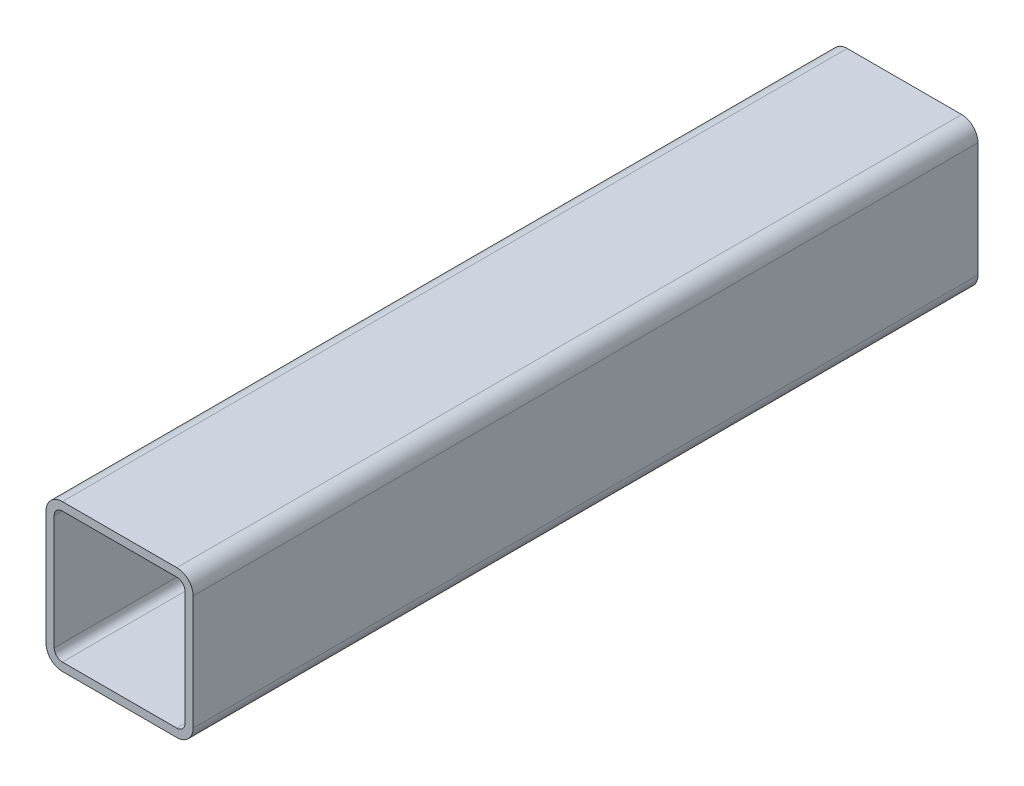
ISO-10303-21;
HEADER;
FILE_DESCRIPTION(('STEP AP214'),'2;1');
FILE_NAME('part.step','',(''),(''),'','','');
FILE_SCHEMA(('AUTOMOTIVE_DESIGN { 1 0 10303 214 1 1 1 1 }'));
ENDSEC;
DATA;
#1=APPLICATION_CONTEXT('core data for automotive mechanical design processes');
#2=APPLICATION_PROTOCOL_DEFINITION('international standard','automotive_design',2000,#1);
#3=PRODUCT_CONTEXT('',#1,'mechanical');
#4=PRODUCT('Part','Part','',(#3));
#5=PRODUCT_RELATED_PRODUCT_CATEGORY('part','',(#4));
#6=PRODUCT_DEFINITION_FORMATION('','',#4);
#7=PRODUCT_DEFINITION_CONTEXT('part definition',#1,'design');
#8=PRODUCT_DEFINITION('design','',#6,#7);
#9=PRODUCT_DEFINITION_SHAPE('','',#8);
#10=(LENGTH_UNIT() NAMED_UNIT(*) SI_UNIT(.MILLI.,.METRE.));
#11=(NAMED_UNIT(*) PLANE_ANGLE_UNIT() SI_UNIT($,.RADIAN.));
#12=(NAMED_UNIT(*) SI_UNIT($,.STERADIAN.) SOLID_ANGLE_UNIT());
#13=UNCERTAINTY_MEASURE_WITH_UNIT(LENGTH_MEASURE(1.E-05),#10,'distance_accuracy_value','');
#14=(GEOMETRIC_REPRESENTATION_CONTEXT(3) GLOBAL_UNCERTAINTY_ASSIGNED_CONTEXT((#13)) GLOBAL_UNIT_ASSIGNED_CONTEXT((#10,
#11,#12)) REPRESENTATION_CONTEXT('',''));
#15=CARTESIAN_POINT('',(0.,0.,0.));
#16=DIRECTION('',(0.,0.,1.));
#17=DIRECTION('',(1.,0.,0.));
#18=AXIS2_PLACEMENT_3D('',#15,#16,#17);
#19=CARTESIAN_POINT('',(6.47805425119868,52.2640005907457,304.8));
#20=DIRECTION('',(0.,0.,1.));
#21=DIRECTION('',(1.,0.,0.));
#22=AXIS2_PLACEMENT_3D('',#19,#20,#21);
#23=PLANE('',#22);
#24=CARTESIAN_POINT('',(6.47805425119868,52.2640005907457,304.8));
#25=DIRECTION('',(0.,0.,1.));
#26=DIRECTION('',(1.,0.,0.));
#27=AXIS2_PLACEMENT_3D('',#24,#25,#26);
#28=CIRCLE('',#27,6.34999999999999);
#29=CARTESIAN_POINT('',(6.47805425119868,58.6140005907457,304.8));
#30=VERTEX_POINT('',#29);
#31=CARTESIAN_POINT('',(0.128054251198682,52.2640005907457,304.8));
#32=VERTEX_POINT('',#31);
#33=EDGE_CURVE('E211',#30,#32,#28,.T.);
#34=ORIENTED_EDGE('',*,*,#33,.T.);
#35=DIRECTION('',(0.,-1.,0.));
#36=VECTOR('',#35,1.);
#37=CARTESIAN_POINT('',(0.128054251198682,7.81400059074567,304.8));
#38=LINE('',#37,#36);
#39=CARTESIAN_POINT('',(0.128054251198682,7.81400059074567,304.8));
#40=VERTEX_POINT('',#39);
#41=EDGE_CURVE('E214',#32,#40,#38,.T.);
#42=ORIENTED_EDGE('',*,*,#41,.T.);
#43=CARTESIAN_POINT('',(6.47805425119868,7.81400059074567,304.8));
#44=DIRECTION('',(0.,0.,1.));
#45=DIRECTION('',(1.,0.,0.));
#46=AXIS2_PLACEMENT_3D('',#43,#44,#45);
#47=CIRCLE('',#46,6.34999999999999);
#48=CARTESIAN_POINT('',(6.47805425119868,1.46400059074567,304.8));
#49=VERTEX_POINT('',#48);
#50=EDGE_CURVE('E217',#40,#49,#47,.T.);
#51=ORIENTED_EDGE('',*,*,#50,.T.);
#52=DIRECTION('',(1.,0.,0.));
#53=VECTOR('',#52,1.);
#54=CARTESIAN_POINT('',(50.9280542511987,1.46400059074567,304.8));
#55=LINE('',#54,#53);
#56=CARTESIAN_POINT('',(50.9280542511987,1.46400059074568,304.8));
#57=VERTEX_POINT('',#56);
#58=EDGE_CURVE('E219',#49,#57,#55,.T.);
#59=ORIENTED_EDGE('',*,*,#58,.T.);
#60=CARTESIAN_POINT('',(50.9280542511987,7.81400059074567,304.8));
#61=DIRECTION('',(0.,0.,1.));
#62=DIRECTION('',(1.,0.,0.));
#63=AXIS2_PLACEMENT_3D('',#60,#61,#62);
#64=CIRCLE('',#63,6.34999999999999);
#65=CARTESIAN_POINT('',(57.2780542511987,7.81400059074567,304.8));
#66=VERTEX_POINT('',#65);
#67=EDGE_CURVE('E221',#57,#66,#64,.T.);
#68=ORIENTED_EDGE('',*,*,#67,.T.);
#69=DIRECTION('',(0.,1.,0.));
#70=VECTOR('',#69,1.);
#71=CARTESIAN_POINT('',(57.2780542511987,52.2640005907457,304.8));
#72=LINE('',#71,#70);
#73=CARTESIAN_POINT('',(57.2780542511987,52.2640005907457,304.8));
#74=VERTEX_POINT('',#73);
#75=EDGE_CURVE('E223',#66,#74,#72,.T.);
#76=ORIENTED_EDGE('',*,*,#75,.T.);
#77=CARTESIAN_POINT('',(50.9280542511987,52.2640005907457,304.8));
#78=DIRECTION('',(0.,0.,1.));
#79=DIRECTION('',(1.,0.,0.));
#80=AXIS2_PLACEMENT_3D('',#77,#78,#79);
#81=CIRCLE('',#80,6.34999999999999);
#82=CARTESIAN_POINT('',(50.9280542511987,58.6140005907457,304.8));
#83=VERTEX_POINT('',#82);
#84=EDGE_CURVE('E225',#74,#83,#81,.T.);
#85=ORIENTED_EDGE('',*,*,#84,.T.);
#86=DIRECTION('',(-1.,0.,0.));
#87=VECTOR('',#86,1.);
#88=CARTESIAN_POINT('',(6.47805425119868,58.6140005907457,304.8));
#89=LINE('',#88,#87);
#90=EDGE_CURVE('E227',#83,#30,#89,.T.);
#91=ORIENTED_EDGE('',*,*,#90,.T.);
#92=EDGE_LOOP('',(#34,#42,#51,#59,#68,#76,#85,#91));
#93=FACE_BOUND('',#92,.T.);
#94=DIRECTION('',(0.,-1.,0.));
#95=VECTOR('',#94,1.);
#96=CARTESIAN_POINT('',(3.30305425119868,7.81400059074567,304.8));
#97=LINE('',#96,#95);
#98=CARTESIAN_POINT('',(3.30305425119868,52.2640005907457,304.8));
#99=VERTEX_POINT('',#98);
#100=CARTESIAN_POINT('',(3.30305425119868,7.81400059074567,304.8));
#101=VERTEX_POINT('',#100);
#102=EDGE_CURVE('E154',#99,#101,#97,.T.);
#103=ORIENTED_EDGE('',*,*,#102,.F.);
#104=CARTESIAN_POINT('',(6.47805425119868,52.2640005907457,304.8));
#105=DIRECTION('',(0.,0.,1.));
#106=DIRECTION('',(1.,0.,0.));
#107=AXIS2_PLACEMENT_3D('',#104,#105,#106);
#108=CIRCLE('',#107,3.175);
#109=CARTESIAN_POINT('',(6.47805425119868,55.4390005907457,304.8));
#110=VERTEX_POINT('',#109);
#111=EDGE_CURVE('E146',#110,#99,#108,.T.);
#112=ORIENTED_EDGE('',*,*,#111,.F.);
#113=DIRECTION('',(-1.,0.,0.));
#114=VECTOR('',#113,1.);
#115=CARTESIAN_POINT('',(6.47805425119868,55.4390005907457,304.8));
#116=LINE('',#115,#114);
#117=CARTESIAN_POINT('',(50.9280542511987,55.4390005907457,304.8));
#118=VERTEX_POINT('',#117);
#119=EDGE_CURVE('E179',#118,#110,#116,.T.);
#120=ORIENTED_EDGE('',*,*,#119,.F.);
#121=CARTESIAN_POINT('',(50.9280542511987,52.2640005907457,304.8));
#122=DIRECTION('',(0.,0.,1.));
#123=DIRECTION('',(1.,0.,0.));
#124=AXIS2_PLACEMENT_3D('',#121,#122,#123);
#125=CIRCLE('',#124,3.175);
#126=CARTESIAN_POINT('',(54.1030542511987,52.2640005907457,304.8));
#127=VERTEX_POINT('',#126);
#128=EDGE_CURVE('E177',#127,#118,#125,.T.);
#129=ORIENTED_EDGE('',*,*,#128,.F.);
#130=DIRECTION('',(0.,1.,0.));
#131=VECTOR('',#130,1.);
#132=CARTESIAN_POINT('',(54.1030542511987,52.2640005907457,304.8));
#133=LINE('',#132,#131);
#134=CARTESIAN_POINT('',(54.1030542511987,7.81400059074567,304.8));
#135=VERTEX_POINT('',#134);
#136=EDGE_CURVE('E175',#135,#127,#133,.T.);
#137=ORIENTED_EDGE('',*,*,#136,.F.);
#138=CARTESIAN_POINT('',(50.9280542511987,7.81400059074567,304.8));
#139=DIRECTION('',(0.,0.,1.));
#140=DIRECTION('',(1.,0.,0.));
#141=AXIS2_PLACEMENT_3D('',#138,#139,#140);
#142=CIRCLE('',#141,3.17499999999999);
#143=CARTESIAN_POINT('',(50.9280542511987,4.63900059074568,304.8));
#144=VERTEX_POINT('',#143);
#145=EDGE_CURVE('E173',#144,#135,#142,.T.);
#146=ORIENTED_EDGE('',*,*,#145,.F.);
#147=DIRECTION('',(1.,0.,0.));
#148=VECTOR('',#147,1.);
#149=CARTESIAN_POINT('',(50.9280542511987,4.63900059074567,304.8));
#150=LINE('',#149,#148);
#151=CARTESIAN_POINT('',(6.47805425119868,4.63900059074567,304.8));
#152=VERTEX_POINT('',#151);
#153=EDGE_CURVE('E169',#152,#144,#150,.T.);
#154=ORIENTED_EDGE('',*,*,#153,.F.);
#155=CARTESIAN_POINT('',(6.47805425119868,7.81400059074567,304.8));
#156=DIRECTION('',(0.,0.,1.));
#157=DIRECTION('',(1.,0.,0.));
#158=AXIS2_PLACEMENT_3D('',#155,#156,#157);
#159=CIRCLE('',#158,3.17499999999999);
#160=EDGE_CURVE('E167',#101,#152,#159,.T.);
#161=ORIENTED_EDGE('',*,*,#160,.F.);
#162=EDGE_LOOP('',(#103,#112,#120,#129,#137,#146,#154,#161));
#163=FACE_BOUND('',#162,.T.);
#164=ADVANCED_FACE('F33',(#93,#163),#23,.T.);
#165=CARTESIAN_POINT('',(6.47805425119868,52.2640005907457,0.));
#166=DIRECTION('',(0.,0.,1.));
#167=DIRECTION('',(1.,0.,0.));
#168=AXIS2_PLACEMENT_3D('',#165,#166,#167);
#169=PLANE('',#168);
#170=CARTESIAN_POINT('',(6.47805425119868,52.2640005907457,0.));
#171=DIRECTION('',(0.,0.,1.));
#172=DIRECTION('',(1.,0.,0.));
#173=AXIS2_PLACEMENT_3D('',#170,#171,#172);
#174=CIRCLE('',#173,6.34999999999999);
#175=CARTESIAN_POINT('',(6.47805425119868,58.6140005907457,0.));
#176=VERTEX_POINT('',#175);
#177=CARTESIAN_POINT('',(0.128054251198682,52.2640005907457,0.));
#178=VERTEX_POINT('',#177);
#179=EDGE_CURVE('E162',#176,#178,#174,.T.);
#180=ORIENTED_EDGE('',*,*,#179,.F.);
#181=DIRECTION('',(-1.,0.,0.));
#182=VECTOR('',#181,1.);
#183=CARTESIAN_POINT('',(6.47805425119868,58.6140005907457,0.));
#184=LINE('',#183,#182);
#185=CARTESIAN_POINT('',(50.9280542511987,58.6140005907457,0.));
#186=VERTEX_POINT('',#185);
#187=EDGE_CURVE('E215',#186,#176,#184,.T.);
#188=ORIENTED_EDGE('',*,*,#187,.F.);
#189=CARTESIAN_POINT('',(50.9280542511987,52.2640005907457,0.));
#190=DIRECTION('',(0.,0.,1.));
#191=DIRECTION('',(1.,0.,0.));
#192=AXIS2_PLACEMENT_3D('',#189,#190,#191);
#193=CIRCLE('',#192,6.34999999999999);
#194=CARTESIAN_POINT('',(57.2780542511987,52.2640005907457,0.));
#195=VERTEX_POINT('',#194);
#196=EDGE_CURVE('E242',#195,#186,#193,.T.);
#197=ORIENTED_EDGE('',*,*,#196,.F.);
#198=DIRECTION('',(0.,1.,0.));
#199=VECTOR('',#198,1.);
#200=CARTESIAN_POINT('',(57.2780542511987,52.2640005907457,0.));
#201=LINE('',#200,#199);
#202=CARTESIAN_POINT('',(57.2780542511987,7.81400059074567,0.));
#203=VERTEX_POINT('',#202);
#204=EDGE_CURVE('E240',#203,#195,#201,.T.);
#205=ORIENTED_EDGE('',*,*,#204,.F.);
#206=CARTESIAN_POINT('',(50.9280542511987,7.81400059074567,0.));
#207=DIRECTION('',(0.,0.,1.));
#208=DIRECTION('',(1.,0.,0.));
#209=AXIS2_PLACEMENT_3D('',#206,#207,#208);
#210=CIRCLE('',#209,6.34999999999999);
#211=CARTESIAN_POINT('',(50.9280542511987,1.46400059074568,0.));
#212=VERTEX_POINT('',#211);
#213=EDGE_CURVE('E238',#212,#203,#210,.T.);
#214=ORIENTED_EDGE('',*,*,#213,.F.);
#215=DIRECTION('',(1.,0.,0.));
#216=VECTOR('',#215,1.);
#217=CARTESIAN_POINT('',(50.9280542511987,1.46400059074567,0.));
#218=LINE('',#217,#216);
#219=CARTESIAN_POINT('',(6.47805425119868,1.46400059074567,0.));
#220=VERTEX_POINT('',#219);
#221=EDGE_CURVE('E236',#220,#212,#218,.T.);
#222=ORIENTED_EDGE('',*,*,#221,.F.);
#223=CARTESIAN_POINT('',(6.47805425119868,7.81400059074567,0.));
#224=DIRECTION('',(0.,0.,1.));
#225=DIRECTION('',(1.,0.,0.));
#226=AXIS2_PLACEMENT_3D('',#223,#224,#225);
#227=CIRCLE('',#226,6.34999999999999);
#228=CARTESIAN_POINT('',(0.128054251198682,7.81400059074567,0.));
#229=VERTEX_POINT('',#228);
#230=EDGE_CURVE('E234',#229,#220,#227,.T.);
#231=ORIENTED_EDGE('',*,*,#230,.F.);
#232=DIRECTION('',(0.,-1.,0.));
#233=VECTOR('',#232,1.);
#234=CARTESIAN_POINT('',(0.128054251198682,7.81400059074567,0.));
#235=LINE('',#234,#233);
#236=EDGE_CURVE('E232',#178,#229,#235,.T.);
#237=ORIENTED_EDGE('',*,*,#236,.F.);
#238=EDGE_LOOP('',(#180,#188,#197,#205,#214,#222,#231,#237));
#239=FACE_BOUND('',#238,.T.);
#240=CARTESIAN_POINT('',(6.47805425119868,52.2640005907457,0.));
#241=DIRECTION('',(0.,0.,1.));
#242=DIRECTION('',(1.,0.,0.));
#243=AXIS2_PLACEMENT_3D('',#240,#241,#242);
#244=CIRCLE('',#243,3.175);
#245=CARTESIAN_POINT('',(6.47805425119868,55.4390005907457,0.));
#246=VERTEX_POINT('',#245);
#247=CARTESIAN_POINT('',(3.30305425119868,52.2640005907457,0.));
#248=VERTEX_POINT('',#247);
#249=EDGE_CURVE('E56',#246,#248,#244,.T.);
#250=ORIENTED_EDGE('',*,*,#249,.T.);
#251=DIRECTION('',(0.,-1.,0.));
#252=VECTOR('',#251,1.);
#253=CARTESIAN_POINT('',(3.30305425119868,7.81400059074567,0.));
#254=LINE('',#253,#252);
#255=CARTESIAN_POINT('',(3.30305425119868,7.81400059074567,0.));
#256=VERTEX_POINT('',#255);
#257=EDGE_CURVE('E161',#248,#256,#254,.T.);
#258=ORIENTED_EDGE('',*,*,#257,.T.);
#259=CARTESIAN_POINT('',(6.47805425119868,7.81400059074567,0.));
#260=DIRECTION('',(0.,0.,1.));
#261=DIRECTION('',(1.,0.,0.));
#262=AXIS2_PLACEMENT_3D('',#259,#260,#261);
#263=CIRCLE('',#262,3.17499999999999);
#264=CARTESIAN_POINT('',(6.47805425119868,4.63900059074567,0.));
#265=VERTEX_POINT('',#264);
#266=EDGE_CURVE('E183',#256,#265,#263,.T.);
#267=ORIENTED_EDGE('',*,*,#266,.T.);
#268=DIRECTION('',(1.,0.,0.));
#269=VECTOR('',#268,1.);
#270=CARTESIAN_POINT('',(50.9280542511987,4.63900059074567,0.));
#271=LINE('',#270,#269);
#272=CARTESIAN_POINT('',(50.9280542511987,4.63900059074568,0.));
#273=VERTEX_POINT('',#272);
#274=EDGE_CURVE('E186',#265,#273,#271,.T.);
#275=ORIENTED_EDGE('',*,*,#274,.T.);
#276=CARTESIAN_POINT('',(50.9280542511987,7.81400059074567,0.));
#277=DIRECTION('',(0.,0.,1.));
#278=DIRECTION('',(1.,0.,0.));
#279=AXIS2_PLACEMENT_3D('',#276,#277,#278);
#280=CIRCLE('',#279,3.17499999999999);
#281=CARTESIAN_POINT('',(54.1030542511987,7.81400059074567,0.));
#282=VERTEX_POINT('',#281);
#283=EDGE_CURVE('E189',#273,#282,#280,.T.);
#284=ORIENTED_EDGE('',*,*,#283,.T.);
#285=DIRECTION('',(0.,1.,0.));
#286=VECTOR('',#285,1.);
#287=CARTESIAN_POINT('',(54.1030542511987,52.2640005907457,0.));
#288=LINE('',#287,#286);
#289=CARTESIAN_POINT('',(54.1030542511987,52.2640005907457,0.));
#290=VERTEX_POINT('',#289);
#291=EDGE_CURVE('E192',#282,#290,#288,.T.);
#292=ORIENTED_EDGE('',*,*,#291,.T.);
#293=CARTESIAN_POINT('',(50.9280542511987,52.2640005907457,0.));
#294=DIRECTION('',(0.,0.,1.));
#295=DIRECTION('',(1.,0.,0.));
#296=AXIS2_PLACEMENT_3D('',#293,#294,#295);
#297=CIRCLE('',#296,3.175);
#298=CARTESIAN_POINT('',(50.9280542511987,55.4390005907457,0.));
#299=VERTEX_POINT('',#298);
#300=EDGE_CURVE('E195',#290,#299,#297,.T.);
#301=ORIENTED_EDGE('',*,*,#300,.T.);
#302=DIRECTION('',(-1.,0.,0.));
#303=VECTOR('',#302,1.);
#304=CARTESIAN_POINT('',(6.47805425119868,55.4390005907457,0.));
#305=LINE('',#304,#303);
#306=EDGE_CURVE('E155',#299,#246,#305,.T.);
#307=ORIENTED_EDGE('',*,*,#306,.T.);
#308=EDGE_LOOP('',(#250,#258,#267,#275,#284,#292,#301,#307));
#309=FACE_BOUND('',#308,.T.);
#310=ADVANCED_FACE('F272',(#239,#309),#169,.F.);
#311=CARTESIAN_POINT('',(6.47805425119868,52.2640005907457,304.8));
#312=DIRECTION('',(0.,0.,-1.));
#313=DIRECTION('',(-1.,0.,0.));
#314=AXIS2_PLACEMENT_3D('',#311,#312,#313);
#315=CYLINDRICAL_SURFACE('',#314,6.34999999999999);
#316=ORIENTED_EDGE('',*,*,#179,.T.);
#317=DIRECTION('',(0.,0.,-1.));
#318=VECTOR('',#317,1.);
#319=CARTESIAN_POINT('',(0.128054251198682,52.2640005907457,304.8));
#320=LINE('',#319,#318);
#321=EDGE_CURVE('E11',#32,#178,#320,.T.);
#322=ORIENTED_EDGE('',*,*,#321,.F.);
#323=ORIENTED_EDGE('',*,*,#33,.F.);
#324=DIRECTION('',(0.,0.,-1.));
#325=VECTOR('',#324,1.);
#326=CARTESIAN_POINT('',(6.47805425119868,58.6140005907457,304.8));
#327=LINE('',#326,#325);
#328=EDGE_CURVE('E229',#30,#176,#327,.T.);
#329=ORIENTED_EDGE('',*,*,#328,.T.);
#330=EDGE_LOOP('',(#316,#322,#323,#329));
#331=FACE_BOUND('',#330,.T.);
#332=ADVANCED_FACE('F35',(#331),#315,.T.);
#333=CARTESIAN_POINT('',(0.128054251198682,7.81400059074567,304.8));
#334=DIRECTION('',(1.,0.,0.));
#335=DIRECTION('',(0.,0.,-1.));
#336=AXIS2_PLACEMENT_3D('',#333,#334,#335);
#337=PLANE('',#336);
#338=ORIENTED_EDGE('',*,*,#236,.T.);
#339=DIRECTION('',(0.,0.,-1.));
#340=VECTOR('',#339,1.);
#341=CARTESIAN_POINT('',(0.128054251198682,7.81400059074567,304.8));
#342=LINE('',#341,#340);
#343=EDGE_CURVE('E41',#40,#229,#342,.T.);
#344=ORIENTED_EDGE('',*,*,#343,.F.);
#345=ORIENTED_EDGE('',*,*,#41,.F.);
#346=ORIENTED_EDGE('',*,*,#321,.T.);
#347=EDGE_LOOP('',(#338,#344,#345,#346));
#348=FACE_BOUND('',#347,.T.);
#349=ADVANCED_FACE('F289',(#348),#337,.F.);
#350=CARTESIAN_POINT('',(6.47805425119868,7.81400059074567,304.8));
#351=DIRECTION('',(0.,0.,-1.));
#352=DIRECTION('',(-1.,0.,0.));
#353=AXIS2_PLACEMENT_3D('',#350,#351,#352);
#354=CYLINDRICAL_SURFACE('',#353,6.34999999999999);
#355=ORIENTED_EDGE('',*,*,#230,.T.);
#356=DIRECTION('',(0.,0.,-1.));
#357=VECTOR('',#356,1.);
#358=CARTESIAN_POINT('',(6.47805425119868,1.46400059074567,304.8));
#359=LINE('',#358,#357);
#360=EDGE_CURVE('E259',#49,#220,#359,.T.);
#361=ORIENTED_EDGE('',*,*,#360,.F.);
#362=ORIENTED_EDGE('',*,*,#50,.F.);
#363=ORIENTED_EDGE('',*,*,#343,.T.);
#364=EDGE_LOOP('',(#355,#361,#362,#363));
#365=FACE_BOUND('',#364,.T.);
#366=ADVANCED_FACE('F266',(#365),#354,.T.);
#367=CARTESIAN_POINT('',(50.9280542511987,1.46400059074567,304.8));
#368=DIRECTION('',(0.,1.,0.));
#369=DIRECTION('',(0.,0.,1.));
#370=AXIS2_PLACEMENT_3D('',#367,#368,#369);
#371=PLANE('',#370);
#372=ORIENTED_EDGE('',*,*,#221,.T.);
#373=DIRECTION('',(0.,0.,-1.));
#374=VECTOR('',#373,1.);
#375=CARTESIAN_POINT('',(50.9280542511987,1.46400059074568,304.8));
#376=LINE('',#375,#374);
#377=EDGE_CURVE('E256',#57,#212,#376,.T.);
#378=ORIENTED_EDGE('',*,*,#377,.F.);
#379=ORIENTED_EDGE('',*,*,#58,.F.);
#380=ORIENTED_EDGE('',*,*,#360,.T.);
#381=EDGE_LOOP('',(#372,#378,#379,#380));
#382=FACE_BOUND('',#381,.T.);
#383=ADVANCED_FACE('F278',(#382),#371,.F.);
#384=CARTESIAN_POINT('',(50.9280542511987,7.81400059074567,304.8));
#385=DIRECTION('',(0.,0.,-1.));
#386=DIRECTION('',(-1.,0.,0.));
#387=AXIS2_PLACEMENT_3D('',#384,#385,#386);
#388=CYLINDRICAL_SURFACE('',#387,6.34999999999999);
#389=ORIENTED_EDGE('',*,*,#213,.T.);
#390=DIRECTION('',(0.,0.,-1.));
#391=VECTOR('',#390,1.);
#392=CARTESIAN_POINT('',(57.2780542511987,7.81400059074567,304.8));
#393=LINE('',#392,#391);
#394=EDGE_CURVE('E253',#66,#203,#393,.T.);
#395=ORIENTED_EDGE('',*,*,#394,.F.);
#396=ORIENTED_EDGE('',*,*,#67,.F.);
#397=ORIENTED_EDGE('',*,*,#377,.T.);
#398=EDGE_LOOP('',(#389,#395,#396,#397));
#399=FACE_BOUND('',#398,.T.);
#400=ADVANCED_FACE('F282',(#399),#388,.T.);
#401=CARTESIAN_POINT('',(57.2780542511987,52.2640005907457,304.8));
#402=DIRECTION('',(-1.,0.,0.));
#403=DIRECTION('',(0.,0.,1.));
#404=AXIS2_PLACEMENT_3D('',#401,#402,#403);
#405=PLANE('',#404);
#406=ORIENTED_EDGE('',*,*,#204,.T.);
#407=DIRECTION('',(0.,0.,-1.));
#408=VECTOR('',#407,1.);
#409=CARTESIAN_POINT('',(57.2780542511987,52.2640005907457,304.8));
#410=LINE('',#409,#408);
#411=EDGE_CURVE('E250',#74,#195,#410,.T.);
#412=ORIENTED_EDGE('',*,*,#411,.F.);
#413=ORIENTED_EDGE('',*,*,#75,.F.);
#414=ORIENTED_EDGE('',*,*,#394,.T.);
#415=EDGE_LOOP('',(#406,#412,#413,#414));
#416=FACE_BOUND('',#415,.T.);
#417=ADVANCED_FACE('F302',(#416),#405,.F.);
#418=CARTESIAN_POINT('',(50.9280542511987,52.2640005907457,304.8));
#419=DIRECTION('',(0.,0.,-1.));
#420=DIRECTION('',(-1.,0.,0.));
#421=AXIS2_PLACEMENT_3D('',#418,#419,#420);
#422=CYLINDRICAL_SURFACE('',#421,6.34999999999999);
#423=ORIENTED_EDGE('',*,*,#196,.T.);
#424=DIRECTION('',(0.,0.,-1.));
#425=VECTOR('',#424,1.);
#426=CARTESIAN_POINT('',(50.9280542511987,58.6140005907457,304.8));
#427=LINE('',#426,#425);
#428=EDGE_CURVE('E247',#83,#186,#427,.T.);
#429=ORIENTED_EDGE('',*,*,#428,.F.);
#430=ORIENTED_EDGE('',*,*,#84,.F.);
#431=ORIENTED_EDGE('',*,*,#411,.T.);
#432=EDGE_LOOP('',(#423,#429,#430,#431));
#433=FACE_BOUND('',#432,.T.);
#434=ADVANCED_FACE('F300',(#433),#422,.T.);
#435=CARTESIAN_POINT('',(6.47805425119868,58.6140005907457,304.8));
#436=DIRECTION('',(0.,-1.,0.));
#437=DIRECTION('',(0.,0.,-1.));
#438=AXIS2_PLACEMENT_3D('',#435,#436,#437);
#439=PLANE('',#438);
#440=ORIENTED_EDGE('',*,*,#187,.T.);
#441=ORIENTED_EDGE('',*,*,#328,.F.);
#442=ORIENTED_EDGE('',*,*,#90,.F.);
#443=ORIENTED_EDGE('',*,*,#428,.T.);
#444=EDGE_LOOP('',(#440,#441,#442,#443));
#445=FACE_BOUND('',#444,.T.);
#446=ADVANCED_FACE('F295',(#445),#439,.F.);
#447=CARTESIAN_POINT('',(6.47805425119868,52.2640005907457,304.8));
#448=DIRECTION('',(0.,0.,-1.));
#449=DIRECTION('',(-1.,0.,0.));
#450=AXIS2_PLACEMENT_3D('',#447,#448,#449);
#451=CYLINDRICAL_SURFACE('',#450,3.175);
#452=ORIENTED_EDGE('',*,*,#249,.F.);
#453=DIRECTION('',(0.,0.,-1.));
#454=VECTOR('',#453,1.);
#455=CARTESIAN_POINT('',(6.47805425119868,55.4390005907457,304.8));
#456=LINE('',#455,#454);
#457=EDGE_CURVE('E150',#110,#246,#456,.T.);
#458=ORIENTED_EDGE('',*,*,#457,.F.);
#459=ORIENTED_EDGE('',*,*,#111,.T.);
#460=DIRECTION('',(0.,0.,-1.));
#461=VECTOR('',#460,1.);
#462=CARTESIAN_POINT('',(3.30305425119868,52.2640005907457,304.8));
#463=LINE('',#462,#461);
#464=EDGE_CURVE('E149',#99,#248,#463,.T.);
#465=ORIENTED_EDGE('',*,*,#464,.T.);
#466=EDGE_LOOP('',(#452,#458,#459,#465));
#467=FACE_BOUND('',#466,.T.);
#468=ADVANCED_FACE('F148',(#467),#451,.F.);
#469=CARTESIAN_POINT('',(3.30305425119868,7.81400059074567,304.8));
#470=DIRECTION('',(1.,0.,0.));
#471=DIRECTION('',(0.,0.,-1.));
#472=AXIS2_PLACEMENT_3D('',#469,#470,#471);
#473=PLANE('',#472);
#474=ORIENTED_EDGE('',*,*,#257,.F.);
#475=ORIENTED_EDGE('',*,*,#464,.F.);
#476=ORIENTED_EDGE('',*,*,#102,.T.);
#477=DIRECTION('',(0.,0.,-1.));
#478=VECTOR('',#477,1.);
#479=CARTESIAN_POINT('',(3.30305425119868,7.81400059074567,304.8));
#480=LINE('',#479,#478);
#481=EDGE_CURVE('E163',#101,#256,#480,.T.);
#482=ORIENTED_EDGE('',*,*,#481,.T.);
#483=EDGE_LOOP('',(#474,#475,#476,#482));
#484=FACE_BOUND('',#483,.T.);
#485=ADVANCED_FACE('F158',(#484),#473,.T.);
#486=CARTESIAN_POINT('',(6.47805425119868,7.81400059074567,304.8));
#487=DIRECTION('',(0.,0.,-1.));
#488=DIRECTION('',(-1.,0.,0.));
#489=AXIS2_PLACEMENT_3D('',#486,#487,#488);
#490=CYLINDRICAL_SURFACE('',#489,3.17499999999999);
#491=ORIENTED_EDGE('',*,*,#266,.F.);
#492=ORIENTED_EDGE('',*,*,#481,.F.);
#493=ORIENTED_EDGE('',*,*,#160,.T.);
#494=DIRECTION('',(0.,0.,-1.));
#495=VECTOR('',#494,1.);
#496=CARTESIAN_POINT('',(6.47805425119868,4.63900059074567,304.8));
#497=LINE('',#496,#495);
#498=EDGE_CURVE('E208',#152,#265,#497,.T.);
#499=ORIENTED_EDGE('',*,*,#498,.T.);
#500=EDGE_LOOP('',(#491,#492,#493,#499));
#501=FACE_BOUND('',#500,.T.);
#502=ADVANCED_FACE('F327',(#501),#490,.F.);
#503=CARTESIAN_POINT('',(50.9280542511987,4.63900059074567,304.8));
#504=DIRECTION('',(0.,1.,0.));
#505=DIRECTION('',(0.,0.,1.));
#506=AXIS2_PLACEMENT_3D('',#503,#504,#505);
#507=PLANE('',#506);
#508=ORIENTED_EDGE('',*,*,#274,.F.);
#509=ORIENTED_EDGE('',*,*,#498,.F.);
#510=ORIENTED_EDGE('',*,*,#153,.T.);
#511=DIRECTION('',(0.,0.,-1.));
#512=VECTOR('',#511,1.);
#513=CARTESIAN_POINT('',(50.9280542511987,4.63900059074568,304.8));
#514=LINE('',#513,#512);
#515=EDGE_CURVE('E206',#144,#273,#514,.T.);
#516=ORIENTED_EDGE('',*,*,#515,.T.);
#517=EDGE_LOOP('',(#508,#509,#510,#516));
#518=FACE_BOUND('',#517,.T.);
#519=ADVANCED_FACE('F331',(#518),#507,.T.);
#520=CARTESIAN_POINT('',(50.9280542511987,7.81400059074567,304.8));
#521=DIRECTION('',(0.,0.,-1.));
#522=DIRECTION('',(-1.,0.,0.));
#523=AXIS2_PLACEMENT_3D('',#520,#521,#522);
#524=CYLINDRICAL_SURFACE('',#523,3.17499999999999);
#525=ORIENTED_EDGE('',*,*,#283,.F.);
#526=ORIENTED_EDGE('',*,*,#515,.F.);
#527=ORIENTED_EDGE('',*,*,#145,.T.);
#528=DIRECTION('',(0.,0.,-1.));
#529=VECTOR('',#528,1.);
#530=CARTESIAN_POINT('',(54.1030542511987,7.81400059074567,304.8));
#531=LINE('',#530,#529);
#532=EDGE_CURVE('E204',#135,#282,#531,.T.);
#533=ORIENTED_EDGE('',*,*,#532,.T.);
#534=EDGE_LOOP('',(#525,#526,#527,#533));
#535=FACE_BOUND('',#534,.T.);
#536=ADVANCED_FACE('F337',(#535),#524,.F.);
#537=CARTESIAN_POINT('',(54.1030542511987,52.2640005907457,304.8));
#538=DIRECTION('',(-1.,0.,0.));
#539=DIRECTION('',(0.,0.,1.));
#540=AXIS2_PLACEMENT_3D('',#537,#538,#539);
#541=PLANE('',#540);
#542=ORIENTED_EDGE('',*,*,#291,.F.);
#543=ORIENTED_EDGE('',*,*,#532,.F.);
#544=ORIENTED_EDGE('',*,*,#136,.T.);
#545=DIRECTION('',(0.,0.,-1.));
#546=VECTOR('',#545,1.);
#547=CARTESIAN_POINT('',(54.1030542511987,52.2640005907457,304.8));
#548=LINE('',#547,#546);
#549=EDGE_CURVE('E202',#127,#290,#548,.T.);
#550=ORIENTED_EDGE('',*,*,#549,.T.);
#551=EDGE_LOOP('',(#542,#543,#544,#550));
#552=FACE_BOUND('',#551,.T.);
#553=ADVANCED_FACE('F341',(#552),#541,.T.);
#554=CARTESIAN_POINT('',(50.9280542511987,52.2640005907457,304.8));
#555=DIRECTION('',(0.,0.,-1.));
#556=DIRECTION('',(-1.,0.,0.));
#557=AXIS2_PLACEMENT_3D('',#554,#555,#556);
#558=CYLINDRICAL_SURFACE('',#557,3.175);
#559=ORIENTED_EDGE('',*,*,#300,.F.);
#560=ORIENTED_EDGE('',*,*,#549,.F.);
#561=ORIENTED_EDGE('',*,*,#128,.T.);
#562=DIRECTION('',(0.,0.,-1.));
#563=VECTOR('',#562,1.);
#564=CARTESIAN_POINT('',(50.9280542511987,55.4390005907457,304.8));
#565=LINE('',#564,#563);
#566=EDGE_CURVE('E48',#118,#299,#565,.T.);
#567=ORIENTED_EDGE('',*,*,#566,.T.);
#568=EDGE_LOOP('',(#559,#560,#561,#567));
#569=FACE_BOUND('',#568,.T.);
#570=ADVANCED_FACE('F345',(#569),#558,.F.);
#571=CARTESIAN_POINT('',(6.47805425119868,55.4390005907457,304.8));
#572=DIRECTION('',(0.,-1.,0.));
#573=DIRECTION('',(0.,0.,-1.));
#574=AXIS2_PLACEMENT_3D('',#571,#572,#573);
#575=PLANE('',#574);
#576=ORIENTED_EDGE('',*,*,#306,.F.);
#577=ORIENTED_EDGE('',*,*,#566,.F.);
#578=ORIENTED_EDGE('',*,*,#119,.T.);
#579=ORIENTED_EDGE('',*,*,#457,.T.);
#580=EDGE_LOOP('',(#576,#577,#578,#579));
#581=FACE_BOUND('',#580,.T.);
#582=ADVANCED_FACE('F349',(#581),#575,.T.);
#583=CLOSED_SHELL('',(#164,#310,#332,#349,#366,#383,#400,#417,#434,#446,#468,#485,#502,#519,
#536,#553,#570,#582));
#584=MANIFOLD_SOLID_BREP('B2',#583);
#585=ADVANCED_BREP_SHAPE_REPRESENTATION('',(#18,#584),#14);
#586=SHAPE_DEFINITION_REPRESENTATION(#9,#585);
ENDSEC;
END-ISO-10303-21;
